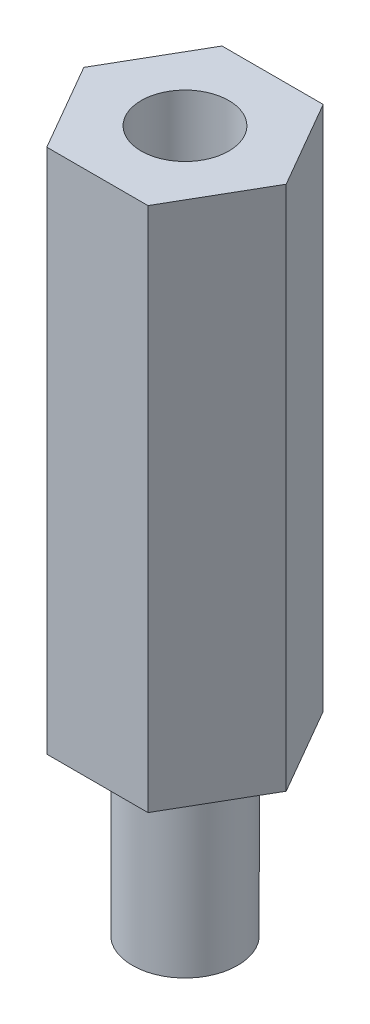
from build123d import *

# Parameters (mm, degrees)
AUFSATZ_LINEAR_AUSTRAGEN1_DEPTH = 30
SKIZZE4_R                       = 3
AUFSATZ_LINEAR_AUSTRAGEN2_DEPTH = 10
SKIZZE5_R                       = 2.5
SCHNITT_LINEAR_AUSTRAGEN1_DEPTH = 11


with BuildPart() as part:
    # Skizze1 → Aufsatz-Linear austragen1 (new body)
    with BuildSketch(Plane(origin=(0, 0, 0), x_dir=(1, 0, 0), z_dir=(0, 1, 0))):
        Polygon((2.886751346, 5), (-2.886751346, 5), (-5.773502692, 0), (-2.886751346, -5), (2.886751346, -5), (5.773502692, 0), align=None)
    extrude(amount=AUFSATZ_LINEAR_AUSTRAGEN1_DEPTH)

    # Skizze4 → Aufsatz-Linear austragen2 (add)
    with BuildSketch(Plane.XZ):
        with Locations(Location((0, 0, 0), (0, 0, 90))):
            Circle(SKIZZE4_R)
    extrude(amount=AUFSATZ_LINEAR_AUSTRAGEN2_DEPTH)

    # Skizze5 → Schnitt-Linear austragen1 (cut)
    with BuildSketch(Plane(origin=(0, 30, 0), x_dir=(1, 0, 0), z_dir=(0, 1, 0))):
        with Locations(Location((0, 0, 0), (0, 0, 270))):
            Circle(SKIZZE5_R)
    extrude(amount=-SCHNITT_LINEAR_AUSTRAGEN1_DEPTH, mode=Mode.SUBTRACT)


solid = part.part
